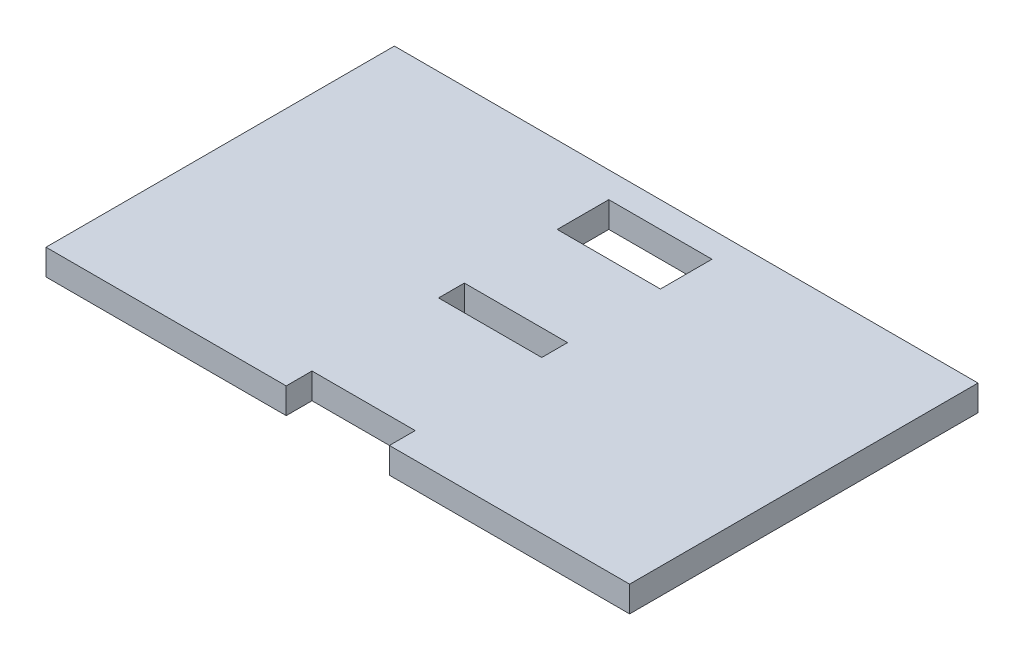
from build123d import *

# Parameters (mm, degrees)
SKETCH1_W           = 20
SKETCH1_H           = 10
SKETCH1_H_2         = 5
BOSS_EXTRUDE1_DEPTH = 5


with BuildPart() as part:
    # Sketch1 → Boss-Extrude1 (new body)
    with BuildSketch(Plane(origin=(0, 0, 0), x_dir=(1, 0, 0), z_dir=(0, 1, 0))):
        Polygon((0, 114.8613654), (113.1189, 114.8613654), (113.1189, 47.338), (66.55945, 47.338), (66.55945, 52.338), (46.55945, 52.338), (46.55945, 47.338), (0, 47.338), align=None)
        with Locations((56.55945, 104.8613654)):
            Rectangle(SKETCH1_W, SKETCH1_H, mode=Mode.SUBTRACT)
        with Locations((56.55945, 79.36424)):
            Rectangle(SKETCH1_W, SKETCH1_H_2, mode=Mode.SUBTRACT)
    extrude(amount=BOSS_EXTRUDE1_DEPTH)


solid = part.part
